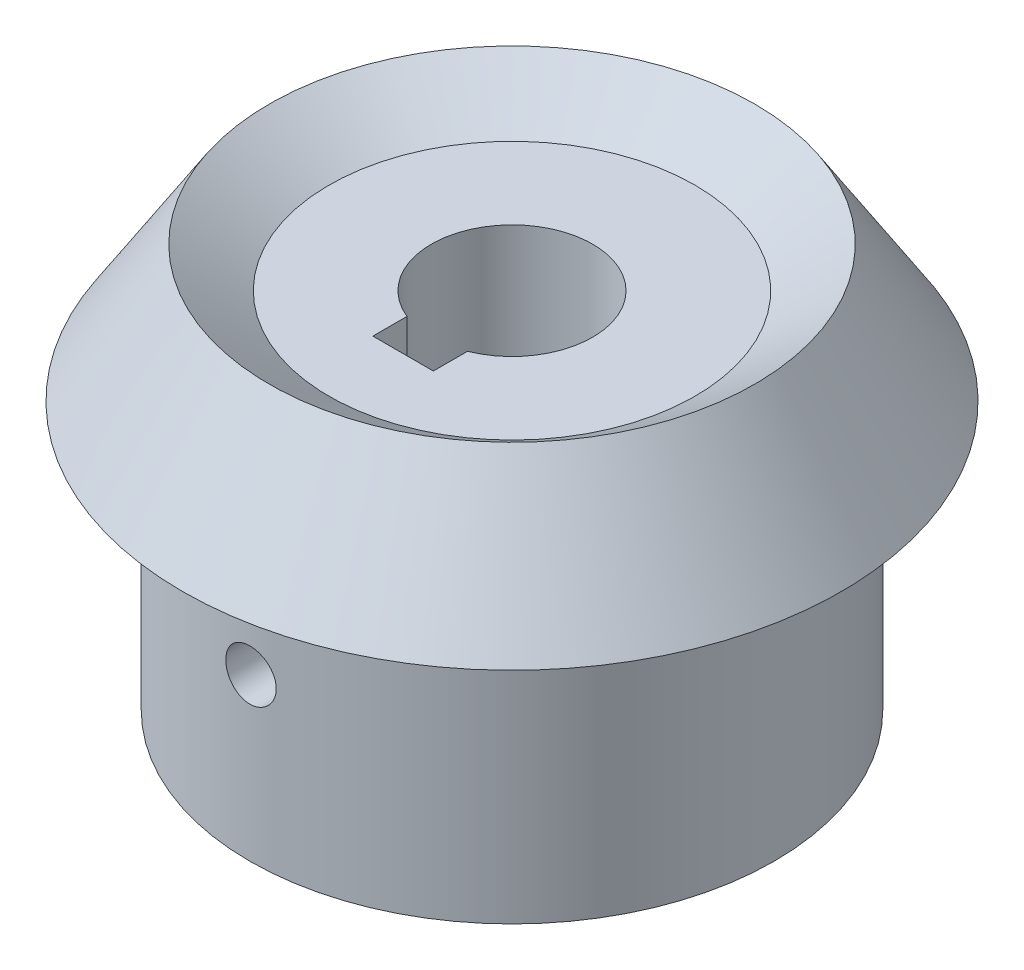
from build123d import *

# Parameters (mm, degrees)
ESQUISSE3_W             = 3
ESQUISSE3_H             = 5.840807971
ENL_V_MAT_EXTRU_1_DEPTH = 31.561269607
ESQUISSE4_W             = 1.25
ESQUISSE4_H             = 13


with BuildPart() as part:
    # Esquisse1 → R_volution1 (revolve)
    with BuildSketch(Plane.XY, mode=Mode.PRIVATE) as r_volution1_sk:
        Polygon((4, 0), (13, 0), (13, 11), (16.34, 13.2545), (12.034158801, 20), (9.071195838, 18), (4, 18), align=None)
    revolve(r_volution1_sk.sketch.rotate(Axis((0, 0, 0), (0, 1, 0)), 90), axis=Axis((0, 0, 0), (0, 1, 0)))

    # Esquisse3 → Enl_v. mat.-Extru.1 (cut, through all)
    with BuildSketch(Plane.XZ):
        with Locations((0, 2.479596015)):
            Rectangle(ESQUISSE3_W, ESQUISSE3_H)
    extrude(amount=-ENL_V_MAT_EXTRU_1_DEPTH, mode=Mode.SUBTRACT)

    # Esquisse4 → Trou taraud_ M3x0.51 (revolve, cut)
    with BuildSketch(Plane(origin=(0, 8, 0), x_dir=(0, 1, 0), z_dir=(1, 0, 0))):
        with Locations((0.625, 6.5)):
            Rectangle(ESQUISSE4_W, ESQUISSE4_H)
    revolve(axis=Axis((0, 8, -6.35), (0, 0, 1)), mode=Mode.SUBTRACT)


solid = part.part
